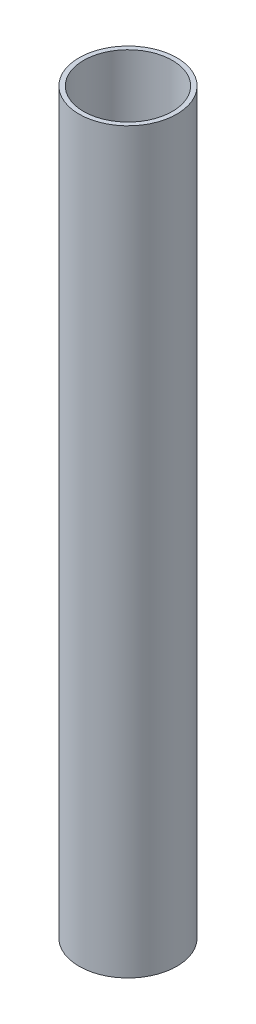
from build123d import *

# Parameters (mm, degrees)
SKETCH1_R      = 70.6628
SKETCH1_R_2    = 64.0969
EXTRUDE1_DEPTH = 533.4


with BuildPart() as part:
    # Sketch1 → Extrude1 (new, symmetric)
    with BuildSketch(Plane(origin=(0, 0, 0), x_dir=(1, 0, 0), z_dir=(0, 1, 0))):
        with Locations(Location((0, 0, 0), (0, 0, 270))):
            Circle(SKETCH1_R)
        with Locations(Location((0, 0, 0), (0, 0, 270))):
            Circle(SKETCH1_R_2, mode=Mode.SUBTRACT)
    extrude(amount=EXTRUDE1_DEPTH, both=True)


solid = part.part
